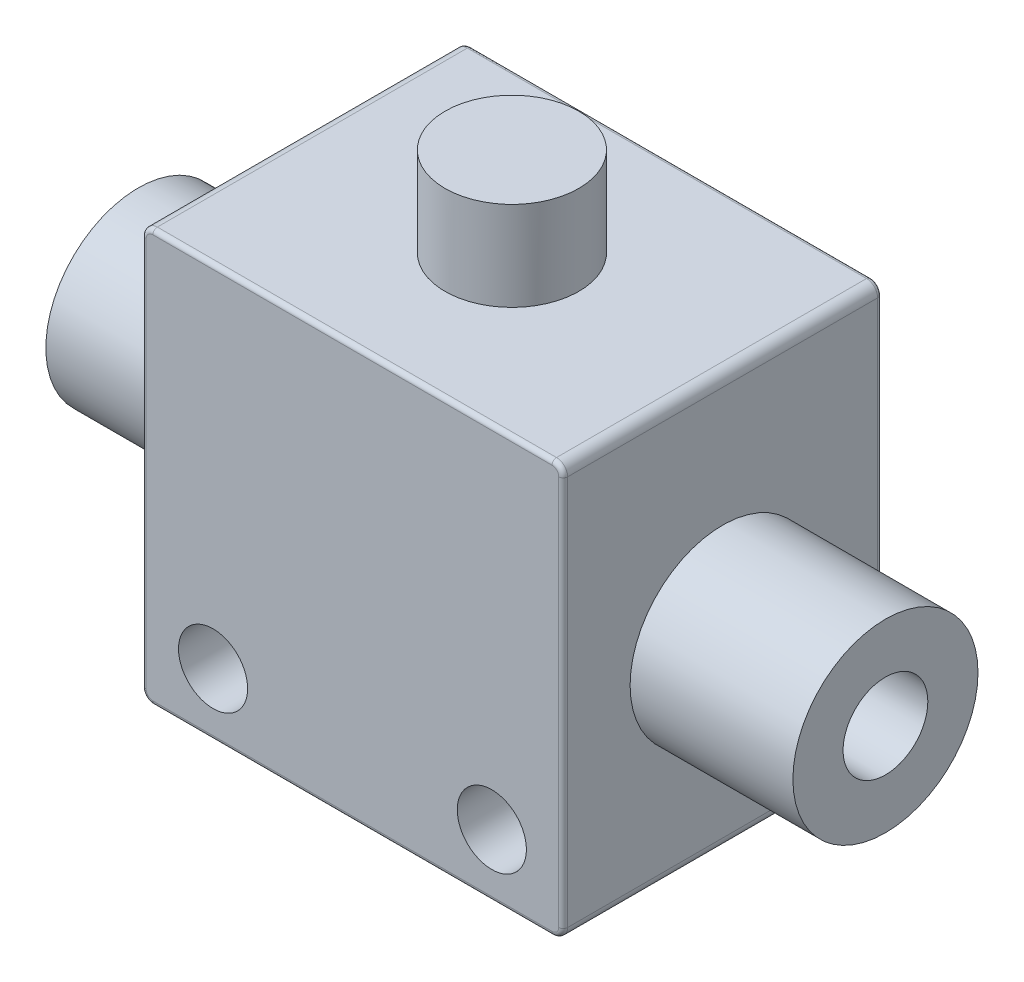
ISO-10303-21;
HEADER;
FILE_DESCRIPTION(('STEP AP214'),'2;1');
FILE_NAME('part.step','',(''),(''),'','','');
FILE_SCHEMA(('AUTOMOTIVE_DESIGN { 1 0 10303 214 1 1 1 1 }'));
ENDSEC;
DATA;
#1=APPLICATION_CONTEXT('core data for automotive mechanical design processes');
#2=APPLICATION_PROTOCOL_DEFINITION('international standard','automotive_design',2000,#1);
#3=PRODUCT_CONTEXT('',#1,'mechanical');
#4=PRODUCT('Part','Part','',(#3));
#5=PRODUCT_RELATED_PRODUCT_CATEGORY('part','',(#4));
#6=PRODUCT_DEFINITION_FORMATION('','',#4);
#7=PRODUCT_DEFINITION_CONTEXT('part definition',#1,'design');
#8=PRODUCT_DEFINITION('design','',#6,#7);
#9=PRODUCT_DEFINITION_SHAPE('','',#8);
#10=(LENGTH_UNIT() NAMED_UNIT(*) SI_UNIT(.MILLI.,.METRE.));
#11=(NAMED_UNIT(*) PLANE_ANGLE_UNIT() SI_UNIT($,.RADIAN.));
#12=(NAMED_UNIT(*) SI_UNIT($,.STERADIAN.) SOLID_ANGLE_UNIT());
#13=UNCERTAINTY_MEASURE_WITH_UNIT(LENGTH_MEASURE(1.E-05),#10,'distance_accuracy_value','');
#14=(GEOMETRIC_REPRESENTATION_CONTEXT(3) GLOBAL_UNCERTAINTY_ASSIGNED_CONTEXT((#13)) GLOBAL_UNIT_ASSIGNED_CONTEXT((#10,
#11,#12)) REPRESENTATION_CONTEXT('',''));
#15=CARTESIAN_POINT('',(0.,0.,0.));
#16=DIRECTION('',(0.,0.,1.));
#17=DIRECTION('',(1.,0.,0.));
#18=AXIS2_PLACEMENT_3D('',#15,#16,#17);
#19=CARTESIAN_POINT('',(0.,23.495,-18.161));
#20=DIRECTION('',(0.,-1.,0.));
#21=DIRECTION('',(0.,0.,-1.));
#22=AXIS2_PLACEMENT_3D('',#19,#20,#21);
#23=PLANE('',#22);
#24=DIRECTION('',(0.,0.,-1.));
#25=VECTOR('',#24,1.);
#26=CARTESIAN_POINT('',(23.368,23.495,-18.161));
#27=LINE('',#26,#25);
#28=CARTESIAN_POINT('',(23.368,23.495,-0.254000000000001));
#29=VERTEX_POINT('',#28);
#30=CARTESIAN_POINT('',(23.368,23.495,-17.907));
#31=VERTEX_POINT('',#30);
#32=EDGE_CURVE('E316',#29,#31,#27,.T.);
#33=ORIENTED_EDGE('',*,*,#32,.T.);
#34=DIRECTION('',(-1.,0.,0.));
#35=VECTOR('',#34,1.);
#36=CARTESIAN_POINT('',(0.,23.495,-17.907));
#37=LINE('',#36,#35);
#38=CARTESIAN_POINT('',(0.635,23.495,-17.907));
#39=VERTEX_POINT('',#38);
#40=EDGE_CURVE('E179',#31,#39,#37,.T.);
#41=ORIENTED_EDGE('',*,*,#40,.T.);
#42=DIRECTION('',(0.,0.,1.));
#43=VECTOR('',#42,1.);
#44=CARTESIAN_POINT('',(0.635,23.495,-18.161));
#45=LINE('',#44,#43);
#46=CARTESIAN_POINT('',(0.635,23.495,-0.254000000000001));
#47=VERTEX_POINT('',#46);
#48=EDGE_CURVE('E313',#39,#47,#45,.T.);
#49=ORIENTED_EDGE('',*,*,#48,.T.);
#50=DIRECTION('',(1.,0.,0.));
#51=VECTOR('',#50,1.);
#52=CARTESIAN_POINT('',(0.,23.495,-0.254000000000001));
#53=LINE('',#52,#51);
#54=EDGE_CURVE('E177',#47,#29,#53,.T.);
#55=ORIENTED_EDGE('',*,*,#54,.T.);
#56=EDGE_LOOP('',(#33,#41,#49,#55));
#57=FACE_BOUND('',#56,.T.);
#58=CARTESIAN_POINT('',(12.0015,23.495,-9.0805));
#59=DIRECTION('',(0.,-1.,0.));
#60=DIRECTION('',(0.,0.,-1.));
#61=AXIS2_PLACEMENT_3D('',#58,#59,#60);
#62=CIRCLE('',#61,3.81);
#63=CARTESIAN_POINT('',(12.0015,23.495,-12.8905));
#64=VERTEX_POINT('',#63);
#65=EDGE_CURVE('E11',#64,#64,#62,.F.);
#66=ORIENTED_EDGE('',*,*,#65,.F.);
#67=EDGE_LOOP('',(#66));
#68=FACE_BOUND('',#67,.T.);
#69=ADVANCED_FACE('F26',(#57,#68),#23,.F.);
#70=CARTESIAN_POINT('',(0.,23.495,0.));
#71=DIRECTION('',(0.,0.,-1.));
#72=DIRECTION('',(-1.,0.,0.));
#73=AXIS2_PLACEMENT_3D('',#70,#71,#72);
#74=PLANE('',#73);
#75=DIRECTION('',(1.,0.,0.));
#76=VECTOR('',#75,1.);
#77=CARTESIAN_POINT('',(0.,23.241,0.));
#78=LINE('',#77,#76);
#79=CARTESIAN_POINT('',(23.368,23.241,0.));
#80=VERTEX_POINT('',#79);
#81=CARTESIAN_POINT('',(0.635,23.241,0.));
#82=VERTEX_POINT('',#81);
#83=EDGE_CURVE('E202',#80,#82,#78,.F.);
#84=ORIENTED_EDGE('',*,*,#83,.T.);
#85=CARTESIAN_POINT('',(0.635,22.86,0.));
#86=DIRECTION('',(0.,0.,-1.));
#87=DIRECTION('',(-1.,0.,0.));
#88=AXIS2_PLACEMENT_3D('',#85,#86,#87);
#89=CIRCLE('',#88,0.381);
#90=CARTESIAN_POINT('',(0.254,22.86,0.));
#91=VERTEX_POINT('',#90);
#92=EDGE_CURVE('E215',#82,#91,#89,.F.);
#93=ORIENTED_EDGE('',*,*,#92,.T.);
#94=DIRECTION('',(0.,-1.,0.));
#95=VECTOR('',#94,1.);
#96=CARTESIAN_POINT('',(0.254,23.495,0.));
#97=LINE('',#96,#95);
#98=CARTESIAN_POINT('',(0.254,0.635,0.));
#99=VERTEX_POINT('',#98);
#100=EDGE_CURVE('E48',#91,#99,#97,.T.);
#101=ORIENTED_EDGE('',*,*,#100,.T.);
#102=CARTESIAN_POINT('',(0.635,0.635,0.));
#103=DIRECTION('',(0.,0.,-1.));
#104=DIRECTION('',(-1.,0.,0.));
#105=AXIS2_PLACEMENT_3D('',#102,#103,#104);
#106=CIRCLE('',#105,0.381);
#107=CARTESIAN_POINT('',(0.635,0.254000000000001,0.));
#108=VERTEX_POINT('',#107);
#109=EDGE_CURVE('E212',#99,#108,#106,.F.);
#110=ORIENTED_EDGE('',*,*,#109,.T.);
#111=DIRECTION('',(1.,0.,0.));
#112=VECTOR('',#111,1.);
#113=CARTESIAN_POINT('',(23.368,0.254000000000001,0.));
#114=LINE('',#113,#112);
#115=CARTESIAN_POINT('',(23.368,0.254,0.));
#116=VERTEX_POINT('',#115);
#117=EDGE_CURVE('E210',#108,#116,#114,.T.);
#118=ORIENTED_EDGE('',*,*,#117,.T.);
#119=CARTESIAN_POINT('',(23.368,0.635,0.));
#120=DIRECTION('',(0.,0.,-1.));
#121=DIRECTION('',(-1.,0.,0.));
#122=AXIS2_PLACEMENT_3D('',#119,#120,#121);
#123=CIRCLE('',#122,0.381);
#124=CARTESIAN_POINT('',(23.749,0.635,0.));
#125=VERTEX_POINT('',#124);
#126=EDGE_CURVE('E208',#116,#125,#123,.F.);
#127=ORIENTED_EDGE('',*,*,#126,.T.);
#128=DIRECTION('',(0.,-1.,0.));
#129=VECTOR('',#128,1.);
#130=CARTESIAN_POINT('',(23.749,23.495,0.));
#131=LINE('',#130,#129);
#132=CARTESIAN_POINT('',(23.749,22.86,0.));
#133=VERTEX_POINT('',#132);
#134=EDGE_CURVE('E206',#125,#133,#131,.F.);
#135=ORIENTED_EDGE('',*,*,#134,.T.);
#136=CARTESIAN_POINT('',(23.368,22.86,0.));
#137=DIRECTION('',(0.,0.,-1.));
#138=DIRECTION('',(-1.,0.,0.));
#139=AXIS2_PLACEMENT_3D('',#136,#137,#138);
#140=CIRCLE('',#139,0.381);
#141=EDGE_CURVE('E204',#133,#80,#140,.F.);
#142=ORIENTED_EDGE('',*,*,#141,.T.);
#143=EDGE_LOOP('',(#84,#93,#101,#110,#118,#127,#135,#142));
#144=FACE_BOUND('',#143,.T.);
#145=CARTESIAN_POINT('',(19.939,3.556,0.));
#146=DIRECTION('',(0.,0.,1.));
#147=DIRECTION('',(1.,0.,0.));
#148=AXIS2_PLACEMENT_3D('',#145,#146,#147);
#149=CIRCLE('',#148,1.9685);
#150=CARTESIAN_POINT('',(21.9075,3.556,0.));
#151=VERTEX_POINT('',#150);
#152=EDGE_CURVE('E290',#151,#151,#149,.T.);
#153=ORIENTED_EDGE('',*,*,#152,.F.);
#154=EDGE_LOOP('',(#153));
#155=FACE_BOUND('',#154,.T.);
#156=CARTESIAN_POINT('',(4.064,3.556,0.));
#157=DIRECTION('',(0.,0.,-1.));
#158=DIRECTION('',(-1.,0.,0.));
#159=AXIS2_PLACEMENT_3D('',#156,#157,#158);
#160=CIRCLE('',#159,1.9685);
#161=CARTESIAN_POINT('',(2.0955,3.556,0.));
#162=VERTEX_POINT('',#161);
#163=EDGE_CURVE('E272',#162,#162,#160,.T.);
#164=ORIENTED_EDGE('',*,*,#163,.T.);
#165=EDGE_LOOP('',(#164));
#166=FACE_BOUND('',#165,.T.);
#167=ADVANCED_FACE('F378',(#144,#155,#166),#74,.F.);
#168=CARTESIAN_POINT('',(0.,23.495,-18.161));
#169=DIRECTION('',(0.,0.,1.));
#170=DIRECTION('',(1.,0.,0.));
#171=AXIS2_PLACEMENT_3D('',#168,#169,#170);
#172=PLANE('',#171);
#173=DIRECTION('',(-1.,0.,0.));
#174=VECTOR('',#173,1.);
#175=CARTESIAN_POINT('',(0.,23.241,-18.161));
#176=LINE('',#175,#174);
#177=CARTESIAN_POINT('',(0.635,23.241,-18.161));
#178=VERTEX_POINT('',#177);
#179=CARTESIAN_POINT('',(23.368,23.241,-18.161));
#180=VERTEX_POINT('',#179);
#181=EDGE_CURVE('E167',#178,#180,#176,.F.);
#182=ORIENTED_EDGE('',*,*,#181,.T.);
#183=CARTESIAN_POINT('',(23.368,22.86,-18.161));
#184=DIRECTION('',(0.,0.,1.));
#185=DIRECTION('',(1.,0.,0.));
#186=AXIS2_PLACEMENT_3D('',#183,#184,#185);
#187=CIRCLE('',#186,0.381);
#188=CARTESIAN_POINT('',(23.749,22.86,-18.161));
#189=VERTEX_POINT('',#188);
#190=EDGE_CURVE('E146',#180,#189,#187,.F.);
#191=ORIENTED_EDGE('',*,*,#190,.T.);
#192=DIRECTION('',(0.,-1.,0.));
#193=VECTOR('',#192,1.);
#194=CARTESIAN_POINT('',(23.749,23.495,-18.161));
#195=LINE('',#194,#193);
#196=CARTESIAN_POINT('',(23.749,0.635,-18.161));
#197=VERTEX_POINT('',#196);
#198=EDGE_CURVE('E155',#189,#197,#195,.T.);
#199=ORIENTED_EDGE('',*,*,#198,.T.);
#200=CARTESIAN_POINT('',(23.368,0.635,-18.161));
#201=DIRECTION('',(0.,0.,1.));
#202=DIRECTION('',(1.,0.,0.));
#203=AXIS2_PLACEMENT_3D('',#200,#201,#202);
#204=CIRCLE('',#203,0.381);
#205=CARTESIAN_POINT('',(23.368,0.254,-18.161));
#206=VERTEX_POINT('',#205);
#207=EDGE_CURVE('E161',#197,#206,#204,.F.);
#208=ORIENTED_EDGE('',*,*,#207,.T.);
#209=DIRECTION('',(-1.,0.,0.));
#210=VECTOR('',#209,1.);
#211=CARTESIAN_POINT('',(0.635,0.254000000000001,-18.161));
#212=LINE('',#211,#210);
#213=CARTESIAN_POINT('',(0.635,0.254000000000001,-18.161));
#214=VERTEX_POINT('',#213);
#215=EDGE_CURVE('E325',#206,#214,#212,.T.);
#216=ORIENTED_EDGE('',*,*,#215,.T.);
#217=CARTESIAN_POINT('',(0.635,0.635,-18.161));
#218=DIRECTION('',(0.,0.,1.));
#219=DIRECTION('',(1.,0.,0.));
#220=AXIS2_PLACEMENT_3D('',#217,#218,#219);
#221=CIRCLE('',#220,0.381);
#222=CARTESIAN_POINT('',(0.254,0.635,-18.161));
#223=VERTEX_POINT('',#222);
#224=EDGE_CURVE('E327',#214,#223,#221,.F.);
#225=ORIENTED_EDGE('',*,*,#224,.T.);
#226=DIRECTION('',(0.,-1.,0.));
#227=VECTOR('',#226,1.);
#228=CARTESIAN_POINT('',(0.254,23.495,-18.161));
#229=LINE('',#228,#227);
#230=CARTESIAN_POINT('',(0.254,22.86,-18.161));
#231=VERTEX_POINT('',#230);
#232=EDGE_CURVE('E329',#223,#231,#229,.F.);
#233=ORIENTED_EDGE('',*,*,#232,.T.);
#234=CARTESIAN_POINT('',(0.635,22.86,-18.161));
#235=DIRECTION('',(0.,0.,1.));
#236=DIRECTION('',(1.,0.,0.));
#237=AXIS2_PLACEMENT_3D('',#234,#235,#236);
#238=CIRCLE('',#237,0.381);
#239=EDGE_CURVE('E172',#231,#178,#238,.F.);
#240=ORIENTED_EDGE('',*,*,#239,.T.);
#241=EDGE_LOOP('',(#182,#191,#199,#208,#216,#225,#233,#240));
#242=FACE_BOUND('',#241,.T.);
#243=CARTESIAN_POINT('',(19.939,3.556,-18.161));
#244=DIRECTION('',(0.,0.,1.));
#245=DIRECTION('',(1.,0.,0.));
#246=AXIS2_PLACEMENT_3D('',#243,#244,#245);
#247=CIRCLE('',#246,1.9685);
#248=CARTESIAN_POINT('',(21.9075,3.556,-18.161));
#249=VERTEX_POINT('',#248);
#250=EDGE_CURVE('E293',#249,#249,#247,.T.);
#251=ORIENTED_EDGE('',*,*,#250,.T.);
#252=EDGE_LOOP('',(#251));
#253=FACE_BOUND('',#252,.T.);
#254=CARTESIAN_POINT('',(4.064,3.556,-18.161));
#255=DIRECTION('',(0.,0.,-1.));
#256=DIRECTION('',(-1.,0.,0.));
#257=AXIS2_PLACEMENT_3D('',#254,#255,#256);
#258=CIRCLE('',#257,1.9685);
#259=CARTESIAN_POINT('',(2.0955,3.556,-18.161));
#260=VERTEX_POINT('',#259);
#261=EDGE_CURVE('E275',#260,#260,#258,.T.);
#262=ORIENTED_EDGE('',*,*,#261,.F.);
#263=EDGE_LOOP('',(#262));
#264=FACE_BOUND('',#263,.T.);
#265=ADVANCED_FACE('F164',(#242,#253,#264),#172,.F.);
#266=CARTESIAN_POINT('',(-9.271,10.795,-9.0805));
#267=DIRECTION('',(-1.,0.,0.));
#268=DIRECTION('',(0.,0.,-1.));
#269=AXIS2_PLACEMENT_3D('',#266,#267,#268);
#270=PLANE('',#269);
#271=CARTESIAN_POINT('',(-9.271,10.795,-9.0805));
#272=DIRECTION('',(1.,0.,0.));
#273=DIRECTION('',(0.,0.,-1.));
#274=AXIS2_PLACEMENT_3D('',#271,#272,#273);
#275=CIRCLE('',#274,5.2705);
#276=CARTESIAN_POINT('',(-9.271,10.795,-14.351));
#277=VERTEX_POINT('',#276);
#278=EDGE_CURVE('E287',#277,#277,#275,.T.);
#279=ORIENTED_EDGE('',*,*,#278,.F.);
#280=EDGE_LOOP('',(#279));
#281=FACE_BOUND('',#280,.T.);
#282=CARTESIAN_POINT('',(-9.271,10.795,-9.0805));
#283=DIRECTION('',(1.,0.,0.));
#284=DIRECTION('',(0.,0.,-1.));
#285=AXIS2_PLACEMENT_3D('',#282,#283,#284);
#286=CIRCLE('',#285,2.413);
#287=CARTESIAN_POINT('',(-9.271,10.795,-6.6675));
#288=VERTEX_POINT('',#287);
#289=EDGE_CURVE('E278',#288,#288,#286,.T.);
#290=ORIENTED_EDGE('',*,*,#289,.T.);
#291=EDGE_LOOP('',(#290));
#292=FACE_BOUND('',#291,.T.);
#293=ADVANCED_FACE('F425',(#281,#292),#270,.T.);
#294=CARTESIAN_POINT('',(24.003,23.495,0.));
#295=DIRECTION('',(-1.,0.,0.));
#296=DIRECTION('',(0.,0.,1.));
#297=AXIS2_PLACEMENT_3D('',#294,#295,#296);
#298=PLANE('',#297);
#299=DIRECTION('',(0.,0.,-1.));
#300=VECTOR('',#299,1.);
#301=CARTESIAN_POINT('',(24.003,22.86,0.));
#302=LINE('',#301,#300);
#303=CARTESIAN_POINT('',(24.003,22.86,-17.907));
#304=VERTEX_POINT('',#303);
#305=CARTESIAN_POINT('',(24.003,22.86,-0.254000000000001));
#306=VERTEX_POINT('',#305);
#307=EDGE_CURVE('E227',#304,#306,#302,.F.);
#308=ORIENTED_EDGE('',*,*,#307,.T.);
#309=DIRECTION('',(0.,-1.,0.));
#310=VECTOR('',#309,1.);
#311=CARTESIAN_POINT('',(24.003,23.495,-0.254));
#312=LINE('',#311,#310);
#313=CARTESIAN_POINT('',(24.003,0.635,-0.254000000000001));
#314=VERTEX_POINT('',#313);
#315=EDGE_CURVE('E34',#306,#314,#312,.T.);
#316=ORIENTED_EDGE('',*,*,#315,.T.);
#317=DIRECTION('',(0.,0.,-1.));
#318=VECTOR('',#317,1.);
#319=CARTESIAN_POINT('',(24.003,0.635,-18.161));
#320=LINE('',#319,#318);
#321=CARTESIAN_POINT('',(24.003,0.635,-17.907));
#322=VERTEX_POINT('',#321);
#323=EDGE_CURVE('E225',#314,#322,#320,.T.);
#324=ORIENTED_EDGE('',*,*,#323,.T.);
#325=DIRECTION('',(0.,-1.,0.));
#326=VECTOR('',#325,1.);
#327=CARTESIAN_POINT('',(24.003,23.495,-17.907));
#328=LINE('',#327,#326);
#329=EDGE_CURVE('E217',#322,#304,#328,.F.);
#330=ORIENTED_EDGE('',*,*,#329,.T.);
#331=EDGE_LOOP('',(#308,#316,#324,#330));
#332=FACE_BOUND('',#331,.T.);
#333=CARTESIAN_POINT('',(24.003,10.795,-9.0805));
#334=DIRECTION('',(-1.,0.,0.));
#335=DIRECTION('',(0.,0.,1.));
#336=AXIS2_PLACEMENT_3D('',#333,#334,#335);
#337=CIRCLE('',#336,5.2705);
#338=CARTESIAN_POINT('',(24.003,10.795,-3.81));
#339=VERTEX_POINT('',#338);
#340=EDGE_CURVE('E305',#339,#339,#337,.F.);
#341=ORIENTED_EDGE('',*,*,#340,.F.);
#342=EDGE_LOOP('',(#341));
#343=FACE_BOUND('',#342,.T.);
#344=ADVANCED_FACE('F223',(#332,#343),#298,.F.);
#345=CARTESIAN_POINT('',(0.,23.495,0.));
#346=DIRECTION('',(1.,0.,0.));
#347=DIRECTION('',(0.,0.,-1.));
#348=AXIS2_PLACEMENT_3D('',#345,#346,#347);
#349=PLANE('',#348);
#350=CARTESIAN_POINT('',(0.,10.795,-9.0805));
#351=DIRECTION('',(1.,0.,0.));
#352=DIRECTION('',(0.,0.,-1.));
#353=AXIS2_PLACEMENT_3D('',#350,#351,#352);
#354=CIRCLE('',#353,5.2705);
#355=CARTESIAN_POINT('',(0.,10.795,-14.351));
#356=VERTEX_POINT('',#355);
#357=EDGE_CURVE('E284',#356,#356,#354,.T.);
#358=ORIENTED_EDGE('',*,*,#357,.T.);
#359=EDGE_LOOP('',(#358));
#360=FACE_BOUND('',#359,.T.);
#361=DIRECTION('',(0.,0.,1.));
#362=VECTOR('',#361,1.);
#363=CARTESIAN_POINT('',(0.,22.86,0.));
#364=LINE('',#363,#362);
#365=CARTESIAN_POINT('',(0.,22.86,-0.254));
#366=VERTEX_POINT('',#365);
#367=CARTESIAN_POINT('',(0.,22.86,-17.907));
#368=VERTEX_POINT('',#367);
#369=EDGE_CURVE('E319',#366,#368,#364,.F.);
#370=ORIENTED_EDGE('',*,*,#369,.T.);
#371=DIRECTION('',(0.,-1.,0.));
#372=VECTOR('',#371,1.);
#373=CARTESIAN_POINT('',(0.,23.495,-17.907));
#374=LINE('',#373,#372);
#375=CARTESIAN_POINT('',(0.,0.635,-17.907));
#376=VERTEX_POINT('',#375);
#377=EDGE_CURVE('E188',#368,#376,#374,.T.);
#378=ORIENTED_EDGE('',*,*,#377,.T.);
#379=DIRECTION('',(0.,0.,1.));
#380=VECTOR('',#379,1.);
#381=CARTESIAN_POINT('',(0.,0.635,0.));
#382=LINE('',#381,#380);
#383=CARTESIAN_POINT('',(0.,0.635,-0.254));
#384=VERTEX_POINT('',#383);
#385=EDGE_CURVE('E162',#376,#384,#382,.T.);
#386=ORIENTED_EDGE('',*,*,#385,.T.);
#387=DIRECTION('',(0.,-1.,0.));
#388=VECTOR('',#387,1.);
#389=CARTESIAN_POINT('',(0.,23.495,-0.254));
#390=LINE('',#389,#388);
#391=EDGE_CURVE('E186',#384,#366,#390,.F.);
#392=ORIENTED_EDGE('',*,*,#391,.T.);
#393=EDGE_LOOP('',(#370,#378,#386,#392));
#394=FACE_BOUND('',#393,.T.);
#395=ADVANCED_FACE('F28',(#360,#394),#349,.F.);
#396=CARTESIAN_POINT('',(0.,0.,-18.161));
#397=DIRECTION('',(0.,-1.,0.));
#398=DIRECTION('',(0.,0.,-1.));
#399=AXIS2_PLACEMENT_3D('',#396,#397,#398);
#400=PLANE('',#399);
#401=DIRECTION('',(0.,0.,1.));
#402=VECTOR('',#401,1.);
#403=CARTESIAN_POINT('',(0.635,0.,-18.161));
#404=LINE('',#403,#402);
#405=CARTESIAN_POINT('',(0.635,0.,-0.254000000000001));
#406=VERTEX_POINT('',#405);
#407=CARTESIAN_POINT('',(0.635,0.,-17.907));
#408=VERTEX_POINT('',#407);
#409=EDGE_CURVE('E238',#406,#408,#404,.F.);
#410=ORIENTED_EDGE('',*,*,#409,.T.);
#411=DIRECTION('',(-1.,0.,0.));
#412=VECTOR('',#411,1.);
#413=CARTESIAN_POINT('',(23.368,0.,-17.907));
#414=LINE('',#413,#412);
#415=CARTESIAN_POINT('',(23.368,0.,-17.907));
#416=VERTEX_POINT('',#415);
#417=EDGE_CURVE('E196',#408,#416,#414,.F.);
#418=ORIENTED_EDGE('',*,*,#417,.T.);
#419=DIRECTION('',(0.,0.,-1.));
#420=VECTOR('',#419,1.);
#421=CARTESIAN_POINT('',(23.368,0.,0.));
#422=LINE('',#421,#420);
#423=CARTESIAN_POINT('',(23.368,0.,-0.254));
#424=VERTEX_POINT('',#423);
#425=EDGE_CURVE('E311',#416,#424,#422,.F.);
#426=ORIENTED_EDGE('',*,*,#425,.T.);
#427=DIRECTION('',(1.,0.,0.));
#428=VECTOR('',#427,1.);
#429=CARTESIAN_POINT('',(0.635,0.,-0.254));
#430=LINE('',#429,#428);
#431=EDGE_CURVE('E194',#424,#406,#430,.F.);
#432=ORIENTED_EDGE('',*,*,#431,.T.);
#433=EDGE_LOOP('',(#410,#418,#426,#432));
#434=FACE_BOUND('',#433,.T.);
#435=ADVANCED_FACE('F387',(#434),#400,.T.);
#436=CARTESIAN_POINT('',(33.274,10.795,-9.0805));
#437=DIRECTION('',(-1.,0.,0.));
#438=DIRECTION('',(0.,0.,1.));
#439=AXIS2_PLACEMENT_3D('',#436,#437,#438);
#440=CYLINDRICAL_SURFACE('',#439,5.2705);
#441=CARTESIAN_POINT('',(33.274,10.795,-9.0805));
#442=DIRECTION('',(1.,0.,0.));
#443=DIRECTION('',(0.,0.,-1.));
#444=AXIS2_PLACEMENT_3D('',#441,#442,#443);
#445=CIRCLE('',#444,5.2705);
#446=CARTESIAN_POINT('',(33.274,10.795,-14.351));
#447=VERTEX_POINT('',#446);
#448=EDGE_CURVE('E302',#447,#447,#445,.T.);
#449=ORIENTED_EDGE('',*,*,#448,.F.);
#450=EDGE_LOOP('',(#449));
#451=FACE_BOUND('',#450,.T.);
#452=ORIENTED_EDGE('',*,*,#340,.T.);
#453=EDGE_LOOP('',(#452));
#454=FACE_BOUND('',#453,.T.);
#455=ADVANCED_FACE('F460',(#451,#454),#440,.T.);
#456=CARTESIAN_POINT('',(33.274,10.795,-9.0805));
#457=DIRECTION('',(1.,0.,0.));
#458=DIRECTION('',(0.,0.,-1.));
#459=AXIS2_PLACEMENT_3D('',#456,#457,#458);
#460=PLANE('',#459);
#461=CARTESIAN_POINT('',(33.274,10.795,-9.0805));
#462=DIRECTION('',(1.,0.,0.));
#463=DIRECTION('',(0.,0.,-1.));
#464=AXIS2_PLACEMENT_3D('',#461,#462,#463);
#465=CIRCLE('',#464,2.413);
#466=CARTESIAN_POINT('',(33.274,10.795,-11.4935));
#467=VERTEX_POINT('',#466);
#468=EDGE_CURVE('E296',#467,#467,#465,.T.);
#469=ORIENTED_EDGE('',*,*,#468,.F.);
#470=EDGE_LOOP('',(#469));
#471=FACE_BOUND('',#470,.T.);
#472=ORIENTED_EDGE('',*,*,#448,.T.);
#473=EDGE_LOOP('',(#472));
#474=FACE_BOUND('',#473,.T.);
#475=ADVANCED_FACE('F457',(#471,#474),#460,.T.);
#476=CARTESIAN_POINT('',(14.224,10.795,-9.0805));
#477=DIRECTION('',(1.,0.,0.));
#478=DIRECTION('',(0.,0.,-1.));
#479=AXIS2_PLACEMENT_3D('',#476,#477,#478);
#480=CYLINDRICAL_SURFACE('',#479,2.413);
#481=CARTESIAN_POINT('',(14.224,10.795,-9.0805));
#482=DIRECTION('',(1.,0.,0.));
#483=DIRECTION('',(0.,0.,-1.));
#484=AXIS2_PLACEMENT_3D('',#481,#482,#483);
#485=CIRCLE('',#484,2.413);
#486=CARTESIAN_POINT('',(14.224,10.795,-11.4935));
#487=VERTEX_POINT('',#486);
#488=EDGE_CURVE('E299',#487,#487,#485,.T.);
#489=CARTESIAN_POINT('',(14.224,10.795,-11.4935));
#490=CARTESIAN_POINT('',(14.4224375,10.795,-11.4935));
#491=CARTESIAN_POINT('',(14.620875,10.795,-11.4935));
#492=CARTESIAN_POINT('',(15.01775,10.795,-11.4935));
#493=CARTESIAN_POINT('',(15.2161875,10.795,-11.4935));
#494=CARTESIAN_POINT('',(15.6130625,10.795,-11.4935));
#495=CARTESIAN_POINT('',(15.8115,10.795,-11.4935));
#496=CARTESIAN_POINT('',(16.208375,10.795,-11.4935));
#497=CARTESIAN_POINT('',(16.4068125,10.795,-11.4935));
#498=CARTESIAN_POINT('',(16.8036875,10.795,-11.4935));
#499=CARTESIAN_POINT('',(17.002125,10.795,-11.4935));
#500=CARTESIAN_POINT('',(17.399,10.795,-11.4935));
#501=CARTESIAN_POINT('',(17.5974375,10.795,-11.4935));
#502=CARTESIAN_POINT('',(17.9943125,10.795,-11.4935));
#503=CARTESIAN_POINT('',(18.19275,10.795,-11.4935));
#504=CARTESIAN_POINT('',(18.589625,10.795,-11.4935));
#505=CARTESIAN_POINT('',(18.7880625,10.795,-11.4935));
#506=CARTESIAN_POINT('',(19.1849375,10.795,-11.4935));
#507=CARTESIAN_POINT('',(19.383375,10.795,-11.4935));
#508=CARTESIAN_POINT('',(19.78025,10.795,-11.4935));
#509=CARTESIAN_POINT('',(19.9786875,10.795,-11.4935));
#510=CARTESIAN_POINT('',(20.3755625,10.795,-11.4935));
#511=CARTESIAN_POINT('',(20.574,10.795,-11.4935));
#512=CARTESIAN_POINT('',(20.970875,10.795,-11.4935));
#513=CARTESIAN_POINT('',(21.1693125,10.795,-11.4935));
#514=CARTESIAN_POINT('',(21.5661875,10.795,-11.4935));
#515=CARTESIAN_POINT('',(21.764625,10.795,-11.4935));
#516=CARTESIAN_POINT('',(22.1615,10.795,-11.4935));
#517=CARTESIAN_POINT('',(22.3599375,10.795,-11.4935));
#518=CARTESIAN_POINT('',(22.7568125,10.795,-11.4935));
#519=CARTESIAN_POINT('',(22.95525,10.795,-11.4935));
#520=CARTESIAN_POINT('',(23.352125,10.795,-11.4935));
#521=CARTESIAN_POINT('',(23.5505625,10.795,-11.4935));
#522=CARTESIAN_POINT('',(23.9474375,10.795,-11.4935));
#523=CARTESIAN_POINT('',(24.145875,10.795,-11.4935));
#524=CARTESIAN_POINT('',(24.54275,10.795,-11.4935));
#525=CARTESIAN_POINT('',(24.7411875,10.795,-11.4935));
#526=CARTESIAN_POINT('',(25.1380625,10.795,-11.4935));
#527=CARTESIAN_POINT('',(25.3365,10.795,-11.4935));
#528=CARTESIAN_POINT('',(25.733375,10.795,-11.4935));
#529=CARTESIAN_POINT('',(25.9318125,10.795,-11.4935));
#530=CARTESIAN_POINT('',(26.3286875,10.795,-11.4935));
#531=CARTESIAN_POINT('',(26.527125,10.795,-11.4935));
#532=CARTESIAN_POINT('',(26.924,10.795,-11.4935));
#533=CARTESIAN_POINT('',(27.1224375,10.795,-11.4935));
#534=CARTESIAN_POINT('',(27.5193125,10.795,-11.4935));
#535=CARTESIAN_POINT('',(27.71775,10.795,-11.4935));
#536=CARTESIAN_POINT('',(28.114625,10.795,-11.4935));
#537=CARTESIAN_POINT('',(28.3130625,10.795,-11.4935));
#538=CARTESIAN_POINT('',(28.7099375,10.795,-11.4935));
#539=CARTESIAN_POINT('',(28.908375,10.795,-11.4935));
#540=CARTESIAN_POINT('',(29.30525,10.795,-11.4935));
#541=CARTESIAN_POINT('',(29.5036875,10.795,-11.4935));
#542=CARTESIAN_POINT('',(29.9005625,10.795,-11.4935));
#543=CARTESIAN_POINT('',(30.099,10.795,-11.4935));
#544=CARTESIAN_POINT('',(30.495875,10.795,-11.4935));
#545=CARTESIAN_POINT('',(30.6943125,10.795,-11.4935));
#546=CARTESIAN_POINT('',(31.0911875,10.795,-11.4935));
#547=CARTESIAN_POINT('',(31.289625,10.795,-11.4935));
#548=CARTESIAN_POINT('',(31.6865,10.795,-11.4935));
#549=CARTESIAN_POINT('',(31.8849375,10.795,-11.4935));
#550=CARTESIAN_POINT('',(32.2818125,10.795,-11.4935));
#551=CARTESIAN_POINT('',(32.48025,10.795,-11.4935));
#552=CARTESIAN_POINT('',(32.877125,10.795,-11.4935));
#553=CARTESIAN_POINT('',(33.0755625,10.795,-11.4935));
#554=CARTESIAN_POINT('',(33.274,10.795,-11.4935));
#555=B_SPLINE_CURVE_WITH_KNOTS('',3,(#489,#490,#491,#492,#493,#494,#495,#496,#497,#498,#499,
#500,#501,#502,#503,#504,#505,#506,#507,#508,#509,#510,#511,#512,#513,#514,#515,#516,#517,#518,
#519,#520,#521,#522,#523,#524,#525,#526,#527,#528,#529,#530,#531,#532,#533,#534,#535,#536,#537,
#538,#539,#540,#541,#542,#543,#544,#545,#546,#547,#548,#549,#550,#551,#552,#553,#554),
.UNSPECIFIED.,.F.,.F.,(4,2,2,2,2,2,2,2,2,2,2,2,2,2,2,2,2,2,2,2,2,2,2,2,2,2,2,2,2,2,2,2,4),(0.,
0.5953125,1.190625,1.7859375,2.38125,2.9765625,3.571875,4.1671875,4.7625,5.3578125,5.953125,
6.5484375,7.14375,7.7390625,8.334375,8.9296875,9.525,10.1203125,10.715625,11.3109375,11.90625,
12.5015625,13.096875,13.6921875,14.2875,14.8828125,15.478125,16.0734375,16.66875,17.2640625,
17.859375,18.4546875,19.05),.UNSPECIFIED.);
#556=EDGE_CURVE('BSEAM453',#487,#467,#555,.T.);
#557=ORIENTED_EDGE('',*,*,#488,.F.);
#558=ORIENTED_EDGE('',*,*,#468,.T.);
#559=ORIENTED_EDGE('',*,*,#556,.T.);
#560=ORIENTED_EDGE('',*,*,#556,.F.);
#561=EDGE_LOOP('',(#557,#559,#558,#560));
#562=FACE_BOUND('',#561,.T.);
#563=ADVANCED_FACE('F453',(#562),#480,.F.);
#564=CARTESIAN_POINT('',(14.224,10.795,-9.0805));
#565=DIRECTION('',(1.,0.,0.));
#566=DIRECTION('',(0.,0.,-1.));
#567=AXIS2_PLACEMENT_3D('',#564,#565,#566);
#568=PLANE('',#567);
#569=ORIENTED_EDGE('',*,*,#488,.T.);
#570=EDGE_LOOP('',(#569));
#571=FACE_BOUND('',#570,.T.);
#572=ADVANCED_FACE('F449',(#571),#568,.T.);
#573=CARTESIAN_POINT('',(19.939,3.556,-18.161));
#574=DIRECTION('',(0.,0.,1.));
#575=DIRECTION('',(1.,0.,0.));
#576=AXIS2_PLACEMENT_3D('',#573,#574,#575);
#577=CYLINDRICAL_SURFACE('',#576,1.9685);
#578=ORIENTED_EDGE('',*,*,#250,.F.);
#579=EDGE_LOOP('',(#578));
#580=FACE_BOUND('',#579,.T.);
#581=ORIENTED_EDGE('',*,*,#152,.T.);
#582=EDGE_LOOP('',(#581));
#583=FACE_BOUND('',#582,.T.);
#584=ADVANCED_FACE('F446',(#580,#583),#577,.F.);
#585=CARTESIAN_POINT('',(-9.271,10.795,-9.0805));
#586=DIRECTION('',(1.,0.,0.));
#587=DIRECTION('',(0.,0.,-1.));
#588=AXIS2_PLACEMENT_3D('',#585,#586,#587);
#589=CYLINDRICAL_SURFACE('',#588,5.2705);
#590=ORIENTED_EDGE('',*,*,#278,.T.);
#591=EDGE_LOOP('',(#590));
#592=FACE_BOUND('',#591,.T.);
#593=ORIENTED_EDGE('',*,*,#357,.F.);
#594=EDGE_LOOP('',(#593));
#595=FACE_BOUND('',#594,.T.);
#596=ADVANCED_FACE('F444',(#592,#595),#589,.T.);
#597=CARTESIAN_POINT('',(9.779,10.795,-9.0805));
#598=DIRECTION('',(-1.,0.,0.));
#599=DIRECTION('',(0.,0.,1.));
#600=AXIS2_PLACEMENT_3D('',#597,#598,#599);
#601=CYLINDRICAL_SURFACE('',#600,2.413);
#602=CARTESIAN_POINT('',(9.779,10.795,-9.0805));
#603=DIRECTION('',(1.,0.,0.));
#604=DIRECTION('',(0.,0.,-1.));
#605=AXIS2_PLACEMENT_3D('',#602,#603,#604);
#606=CIRCLE('',#605,2.413);
#607=CARTESIAN_POINT('',(9.779,10.795,-6.6675));
#608=VERTEX_POINT('',#607);
#609=EDGE_CURVE('E281',#608,#608,#606,.T.);
#610=CARTESIAN_POINT('',(9.779,10.795,-6.6675));
#611=CARTESIAN_POINT('',(9.5805625,10.795,-6.6675));
#612=CARTESIAN_POINT('',(9.382125,10.795,-6.6675));
#613=CARTESIAN_POINT('',(8.98525,10.795,-6.6675));
#614=CARTESIAN_POINT('',(8.7868125,10.795,-6.6675));
#615=CARTESIAN_POINT('',(8.3899375,10.795,-6.6675));
#616=CARTESIAN_POINT('',(8.1915,10.795,-6.6675));
#617=CARTESIAN_POINT('',(7.794625,10.795,-6.6675));
#618=CARTESIAN_POINT('',(7.5961875,10.795,-6.6675));
#619=CARTESIAN_POINT('',(7.1993125,10.795,-6.6675));
#620=CARTESIAN_POINT('',(7.000875,10.795,-6.6675));
#621=CARTESIAN_POINT('',(6.604,10.795,-6.6675));
#622=CARTESIAN_POINT('',(6.4055625,10.795,-6.6675));
#623=CARTESIAN_POINT('',(6.0086875,10.795,-6.6675));
#624=CARTESIAN_POINT('',(5.81025,10.795,-6.6675));
#625=CARTESIAN_POINT('',(5.413375,10.795,-6.6675));
#626=CARTESIAN_POINT('',(5.2149375,10.795,-6.6675));
#627=CARTESIAN_POINT('',(4.8180625,10.795,-6.6675));
#628=CARTESIAN_POINT('',(4.619625,10.795,-6.6675));
#629=CARTESIAN_POINT('',(4.22275,10.795,-6.6675));
#630=CARTESIAN_POINT('',(4.0243125,10.795,-6.6675));
#631=CARTESIAN_POINT('',(3.6274375,10.795,-6.6675));
#632=CARTESIAN_POINT('',(3.429,10.795,-6.6675));
#633=CARTESIAN_POINT('',(3.032125,10.795,-6.6675));
#634=CARTESIAN_POINT('',(2.8336875,10.795,-6.6675));
#635=CARTESIAN_POINT('',(2.4368125,10.795,-6.6675));
#636=CARTESIAN_POINT('',(2.238375,10.795,-6.6675));
#637=CARTESIAN_POINT('',(1.8415,10.795,-6.6675));
#638=CARTESIAN_POINT('',(1.6430625,10.795,-6.6675));
#639=CARTESIAN_POINT('',(1.2461875,10.795,-6.6675));
#640=CARTESIAN_POINT('',(1.04775,10.795,-6.6675));
#641=CARTESIAN_POINT('',(0.650874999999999,10.795,-6.6675));
#642=CARTESIAN_POINT('',(0.452437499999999,10.795,-6.6675));
#643=CARTESIAN_POINT('',(0.0555624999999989,10.795,-6.6675));
#644=CARTESIAN_POINT('',(-0.142875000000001,10.795,-6.6675));
#645=CARTESIAN_POINT('',(-0.539750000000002,10.795,-6.6675));
#646=CARTESIAN_POINT('',(-0.738187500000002,10.795,-6.6675));
#647=CARTESIAN_POINT('',(-1.1350625,10.795,-6.6675));
#648=CARTESIAN_POINT('',(-1.3335,10.795,-6.6675));
#649=CARTESIAN_POINT('',(-1.730375,10.795,-6.6675));
#650=CARTESIAN_POINT('',(-1.9288125,10.795,-6.6675));
#651=CARTESIAN_POINT('',(-2.3256875,10.795,-6.6675));
#652=CARTESIAN_POINT('',(-2.524125,10.795,-6.6675));
#653=CARTESIAN_POINT('',(-2.921,10.795,-6.6675));
#654=CARTESIAN_POINT('',(-3.1194375,10.795,-6.6675));
#655=CARTESIAN_POINT('',(-3.5163125,10.795,-6.6675));
#656=CARTESIAN_POINT('',(-3.71475,10.795,-6.6675));
#657=CARTESIAN_POINT('',(-4.111625,10.795,-6.6675));
#658=CARTESIAN_POINT('',(-4.3100625,10.795,-6.6675));
#659=CARTESIAN_POINT('',(-4.7069375,10.795,-6.6675));
#660=CARTESIAN_POINT('',(-4.905375,10.795,-6.6675));
#661=CARTESIAN_POINT('',(-5.30225,10.795,-6.6675));
#662=CARTESIAN_POINT('',(-5.5006875,10.795,-6.6675));
#663=CARTESIAN_POINT('',(-5.8975625,10.795,-6.6675));
#664=CARTESIAN_POINT('',(-6.096,10.795,-6.6675));
#665=CARTESIAN_POINT('',(-6.492875,10.795,-6.6675));
#666=CARTESIAN_POINT('',(-6.6913125,10.795,-6.6675));
#667=CARTESIAN_POINT('',(-7.0881875,10.795,-6.6675));
#668=CARTESIAN_POINT('',(-7.286625,10.795,-6.6675));
#669=CARTESIAN_POINT('',(-7.6835,10.795,-6.6675));
#670=CARTESIAN_POINT('',(-7.8819375,10.795,-6.6675));
#671=CARTESIAN_POINT('',(-8.2788125,10.795,-6.6675));
#672=CARTESIAN_POINT('',(-8.47725,10.795,-6.6675));
#673=CARTESIAN_POINT('',(-8.874125,10.795,-6.6675));
#674=CARTESIAN_POINT('',(-9.0725625,10.795,-6.6675));
#675=CARTESIAN_POINT('',(-9.271,10.795,-6.6675));
#676=B_SPLINE_CURVE_WITH_KNOTS('',3,(#610,#611,#612,#613,#614,#615,#616,#617,#618,#619,#620,
#621,#622,#623,#624,#625,#626,#627,#628,#629,#630,#631,#632,#633,#634,#635,#636,#637,#638,#639,
#640,#641,#642,#643,#644,#645,#646,#647,#648,#649,#650,#651,#652,#653,#654,#655,#656,#657,#658,
#659,#660,#661,#662,#663,#664,#665,#666,#667,#668,#669,#670,#671,#672,#673,#674,#675),
.UNSPECIFIED.,.F.,.F.,(4,2,2,2,2,2,2,2,2,2,2,2,2,2,2,2,2,2,2,2,2,2,2,2,2,2,2,2,2,2,2,2,4),(0.,
0.5953125,1.190625,1.7859375,2.38125,2.9765625,3.571875,4.1671875,4.7625,5.3578125,5.953125,
6.5484375,7.14375,7.7390625,8.334375,8.9296875,9.525,10.1203125,10.715625,11.3109375,11.90625,
12.5015625,13.096875,13.6921875,14.2875,14.8828125,15.478125,16.0734375,16.66875,17.2640625,
17.859375,18.4546875,19.05),.UNSPECIFIED.);
#677=EDGE_CURVE('BSEAM442',#608,#288,#676,.T.);
#678=ORIENTED_EDGE('',*,*,#609,.T.);
#679=ORIENTED_EDGE('',*,*,#289,.F.);
#680=ORIENTED_EDGE('',*,*,#677,.T.);
#681=ORIENTED_EDGE('',*,*,#677,.F.);
#682=EDGE_LOOP('',(#678,#680,#679,#681));
#683=FACE_BOUND('',#682,.T.);
#684=ADVANCED_FACE('F442',(#683),#601,.F.);
#685=CARTESIAN_POINT('',(9.779,10.795,-9.0805));
#686=DIRECTION('',(-1.,0.,0.));
#687=DIRECTION('',(0.,0.,-1.));
#688=AXIS2_PLACEMENT_3D('',#685,#686,#687);
#689=PLANE('',#688);
#690=ORIENTED_EDGE('',*,*,#609,.F.);
#691=EDGE_LOOP('',(#690));
#692=FACE_BOUND('',#691,.T.);
#693=ADVANCED_FACE('F616',(#692),#689,.T.);
#694=CARTESIAN_POINT('',(4.064,3.556,-18.161));
#695=DIRECTION('',(0.,0.,1.));
#696=DIRECTION('',(1.,0.,0.));
#697=AXIS2_PLACEMENT_3D('',#694,#695,#696);
#698=CYLINDRICAL_SURFACE('',#697,1.9685);
#699=ORIENTED_EDGE('',*,*,#261,.T.);
#700=EDGE_LOOP('',(#699));
#701=FACE_BOUND('',#700,.T.);
#702=ORIENTED_EDGE('',*,*,#163,.F.);
#703=EDGE_LOOP('',(#702));
#704=FACE_BOUND('',#703,.T.);
#705=ADVANCED_FACE('F481',(#701,#704),#698,.F.);
#706=CARTESIAN_POINT('',(23.368,0.635,0.));
#707=DIRECTION('',(0.,0.,1.));
#708=DIRECTION('',(1.,0.,0.));
#709=AXIS2_PLACEMENT_3D('',#706,#707,#708);
#710=CYLINDRICAL_SURFACE('',#709,0.635);
#711=ORIENTED_EDGE('',*,*,#425,.F.);
#712=CARTESIAN_POINT('',(23.368,0.635,-17.907));
#713=DIRECTION('',(0.,0.,1.));
#714=DIRECTION('',(1.,0.,0.));
#715=AXIS2_PLACEMENT_3D('',#712,#713,#714);
#716=CIRCLE('',#715,0.635);
#717=EDGE_CURVE('E200',#416,#322,#716,.T.);
#718=ORIENTED_EDGE('',*,*,#717,.T.);
#719=ORIENTED_EDGE('',*,*,#323,.F.);
#720=CARTESIAN_POINT('',(23.368,0.635,-0.254));
#721=DIRECTION('',(0.,0.,-1.));
#722=DIRECTION('',(-1.,0.,0.));
#723=AXIS2_PLACEMENT_3D('',#720,#721,#722);
#724=CIRCLE('',#723,0.635);
#725=EDGE_CURVE('E198',#314,#424,#724,.T.);
#726=ORIENTED_EDGE('',*,*,#725,.T.);
#727=EDGE_LOOP('',(#711,#718,#719,#726));
#728=FACE_BOUND('',#727,.T.);
#729=ADVANCED_FACE('F235',(#728),#710,.T.);
#730=CARTESIAN_POINT('',(23.368,22.86,-18.161));
#731=DIRECTION('',(0.,0.,-1.));
#732=DIRECTION('',(-1.,0.,0.));
#733=AXIS2_PLACEMENT_3D('',#730,#731,#732);
#734=CYLINDRICAL_SURFACE('',#733,0.635);
#735=ORIENTED_EDGE('',*,*,#307,.F.);
#736=CARTESIAN_POINT('',(23.368,22.86,-17.907));
#737=DIRECTION('',(0.,0.,1.));
#738=DIRECTION('',(1.,0.,0.));
#739=AXIS2_PLACEMENT_3D('',#736,#737,#738);
#740=CIRCLE('',#739,0.635);
#741=EDGE_CURVE('E148',#304,#31,#740,.T.);
#742=ORIENTED_EDGE('',*,*,#741,.T.);
#743=ORIENTED_EDGE('',*,*,#32,.F.);
#744=CARTESIAN_POINT('',(23.368,22.86,-0.254000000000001));
#745=DIRECTION('',(0.,0.,-1.));
#746=DIRECTION('',(-1.,0.,0.));
#747=AXIS2_PLACEMENT_3D('',#744,#745,#746);
#748=CIRCLE('',#747,0.635);
#749=EDGE_CURVE('E169',#29,#306,#748,.T.);
#750=ORIENTED_EDGE('',*,*,#749,.T.);
#751=EDGE_LOOP('',(#735,#742,#743,#750));
#752=FACE_BOUND('',#751,.T.);
#753=ADVANCED_FACE('F344',(#752),#734,.T.);
#754=CARTESIAN_POINT('',(0.635,0.635,0.));
#755=DIRECTION('',(0.,0.,-1.));
#756=DIRECTION('',(-1.,0.,0.));
#757=AXIS2_PLACEMENT_3D('',#754,#755,#756);
#758=CYLINDRICAL_SURFACE('',#757,0.635);
#759=ORIENTED_EDGE('',*,*,#385,.F.);
#760=CARTESIAN_POINT('',(0.635,0.635,-17.907));
#761=DIRECTION('',(0.,0.,1.));
#762=DIRECTION('',(1.,0.,0.));
#763=AXIS2_PLACEMENT_3D('',#760,#761,#762);
#764=CIRCLE('',#763,0.635);
#765=EDGE_CURVE('E192',#376,#408,#764,.T.);
#766=ORIENTED_EDGE('',*,*,#765,.T.);
#767=ORIENTED_EDGE('',*,*,#409,.F.);
#768=CARTESIAN_POINT('',(0.635,0.635,-0.254));
#769=DIRECTION('',(0.,0.,-1.));
#770=DIRECTION('',(-1.,0.,0.));
#771=AXIS2_PLACEMENT_3D('',#768,#769,#770);
#772=CIRCLE('',#771,0.635);
#773=EDGE_CURVE('E190',#406,#384,#772,.T.);
#774=ORIENTED_EDGE('',*,*,#773,.T.);
#775=EDGE_LOOP('',(#759,#766,#767,#774));
#776=FACE_BOUND('',#775,.T.);
#777=ADVANCED_FACE('F391',(#776),#758,.T.);
#778=CARTESIAN_POINT('',(0.635,22.86,-18.161));
#779=DIRECTION('',(0.,0.,1.));
#780=DIRECTION('',(1.,0.,0.));
#781=AXIS2_PLACEMENT_3D('',#778,#779,#780);
#782=CYLINDRICAL_SURFACE('',#781,0.635);
#783=ORIENTED_EDGE('',*,*,#48,.F.);
#784=CARTESIAN_POINT('',(0.635,22.86,-17.907));
#785=DIRECTION('',(0.,0.,1.));
#786=DIRECTION('',(1.,0.,0.));
#787=AXIS2_PLACEMENT_3D('',#784,#785,#786);
#788=CIRCLE('',#787,0.635);
#789=EDGE_CURVE('E184',#39,#368,#788,.T.);
#790=ORIENTED_EDGE('',*,*,#789,.T.);
#791=ORIENTED_EDGE('',*,*,#369,.F.);
#792=CARTESIAN_POINT('',(0.635,22.86,-0.254000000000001));
#793=DIRECTION('',(0.,0.,-1.));
#794=DIRECTION('',(-1.,0.,0.));
#795=AXIS2_PLACEMENT_3D('',#792,#793,#794);
#796=CIRCLE('',#795,0.635);
#797=EDGE_CURVE('E181',#366,#47,#796,.T.);
#798=ORIENTED_EDGE('',*,*,#797,.T.);
#799=EDGE_LOOP('',(#783,#790,#791,#798));
#800=FACE_BOUND('',#799,.T.);
#801=ADVANCED_FACE('F358',(#800),#782,.T.);
#802=CARTESIAN_POINT('',(0.635,0.635,-17.907));
#803=DIRECTION('',(0.,0.,1.));
#804=DIRECTION('',(1.,0.,0.));
#805=AXIS2_PLACEMENT_3D('',#802,#803,#804);
#806=TOROIDAL_SURFACE('',#805,0.381,0.254);
#807=CARTESIAN_POINT('',(0.635,0.254,-17.907));
#808=DIRECTION('',(1.,0.,0.));
#809=DIRECTION('',(0.,0.,-1.));
#810=AXIS2_PLACEMENT_3D('',#807,#808,#809);
#811=CIRCLE('',#810,0.254);
#812=EDGE_CURVE('E266',#408,#214,#811,.T.);
#813=ORIENTED_EDGE('',*,*,#812,.F.);
#814=ORIENTED_EDGE('',*,*,#765,.F.);
#815=CARTESIAN_POINT('',(0.254,0.635,-17.907));
#816=DIRECTION('',(0.,1.,0.));
#817=DIRECTION('',(0.,0.,1.));
#818=AXIS2_PLACEMENT_3D('',#815,#816,#817);
#819=CIRCLE('',#818,0.254);
#820=EDGE_CURVE('E269',#223,#376,#819,.T.);
#821=ORIENTED_EDGE('',*,*,#820,.F.);
#822=ORIENTED_EDGE('',*,*,#224,.F.);
#823=EDGE_LOOP('',(#813,#814,#821,#822));
#824=FACE_BOUND('',#823,.T.);
#825=ADVANCED_FACE('F395',(#824),#806,.T.);
#826=CARTESIAN_POINT('',(0.254,23.495,-17.907));
#827=DIRECTION('',(0.,-1.,0.));
#828=DIRECTION('',(0.,0.,-1.));
#829=AXIS2_PLACEMENT_3D('',#826,#827,#828);
#830=CYLINDRICAL_SURFACE('',#829,0.254);
#831=ORIENTED_EDGE('',*,*,#820,.T.);
#832=ORIENTED_EDGE('',*,*,#377,.F.);
#833=CARTESIAN_POINT('',(0.254,22.86,-17.907));
#834=DIRECTION('',(0.,1.,0.));
#835=DIRECTION('',(0.,0.,1.));
#836=AXIS2_PLACEMENT_3D('',#833,#834,#835);
#837=CIRCLE('',#836,0.254);
#838=EDGE_CURVE('E263',#231,#368,#837,.T.);
#839=ORIENTED_EDGE('',*,*,#838,.F.);
#840=ORIENTED_EDGE('',*,*,#232,.F.);
#841=EDGE_LOOP('',(#831,#832,#839,#840));
#842=FACE_BOUND('',#841,.T.);
#843=ADVANCED_FACE('F400',(#842),#830,.T.);
#844=CARTESIAN_POINT('',(0.,0.254000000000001,-17.907));
#845=DIRECTION('',(1.,0.,0.));
#846=DIRECTION('',(0.,0.,-1.));
#847=AXIS2_PLACEMENT_3D('',#844,#845,#846);
#848=CYLINDRICAL_SURFACE('',#847,0.254);
#849=ORIENTED_EDGE('',*,*,#812,.T.);
#850=ORIENTED_EDGE('',*,*,#215,.F.);
#851=CARTESIAN_POINT('',(23.368,0.254,-17.907));
#852=DIRECTION('',(1.,0.,0.));
#853=DIRECTION('',(0.,0.,-1.));
#854=AXIS2_PLACEMENT_3D('',#851,#852,#853);
#855=CIRCLE('',#854,0.254);
#856=EDGE_CURVE('E260',#416,#206,#855,.T.);
#857=ORIENTED_EDGE('',*,*,#856,.F.);
#858=ORIENTED_EDGE('',*,*,#417,.F.);
#859=EDGE_LOOP('',(#849,#850,#857,#858));
#860=FACE_BOUND('',#859,.T.);
#861=ADVANCED_FACE('F513',(#860),#848,.T.);
#862=CARTESIAN_POINT('',(0.635,22.86,-17.907));
#863=DIRECTION('',(0.,0.,1.));
#864=DIRECTION('',(1.,0.,0.));
#865=AXIS2_PLACEMENT_3D('',#862,#863,#864);
#866=TOROIDAL_SURFACE('',#865,0.381,0.254);
#867=ORIENTED_EDGE('',*,*,#838,.T.);
#868=ORIENTED_EDGE('',*,*,#789,.F.);
#869=CARTESIAN_POINT('',(0.635,23.241,-17.907));
#870=DIRECTION('',(1.,0.,0.));
#871=DIRECTION('',(0.,0.,-1.));
#872=AXIS2_PLACEMENT_3D('',#869,#870,#871);
#873=CIRCLE('',#872,0.254);
#874=EDGE_CURVE('E257',#178,#39,#873,.T.);
#875=ORIENTED_EDGE('',*,*,#874,.F.);
#876=ORIENTED_EDGE('',*,*,#239,.F.);
#877=EDGE_LOOP('',(#867,#868,#875,#876));
#878=FACE_BOUND('',#877,.T.);
#879=ADVANCED_FACE('F336',(#878),#866,.T.);
#880=CARTESIAN_POINT('',(23.368,0.635,-17.907));
#881=DIRECTION('',(0.,0.,1.));
#882=DIRECTION('',(1.,0.,0.));
#883=AXIS2_PLACEMENT_3D('',#880,#881,#882);
#884=TOROIDAL_SURFACE('',#883,0.381,0.254);
#885=ORIENTED_EDGE('',*,*,#856,.T.);
#886=ORIENTED_EDGE('',*,*,#207,.F.);
#887=CARTESIAN_POINT('',(23.749,0.635,-17.907));
#888=DIRECTION('',(0.,1.,0.));
#889=DIRECTION('',(0.,0.,1.));
#890=AXIS2_PLACEMENT_3D('',#887,#888,#889);
#891=CIRCLE('',#890,0.254);
#892=EDGE_CURVE('E158',#322,#197,#891,.T.);
#893=ORIENTED_EDGE('',*,*,#892,.F.);
#894=ORIENTED_EDGE('',*,*,#717,.F.);
#895=EDGE_LOOP('',(#885,#886,#893,#894));
#896=FACE_BOUND('',#895,.T.);
#897=ADVANCED_FACE('F527',(#896),#884,.T.);
#898=CARTESIAN_POINT('',(0.,23.241,-17.907));
#899=DIRECTION('',(-1.,0.,0.));
#900=DIRECTION('',(0.,0.,1.));
#901=AXIS2_PLACEMENT_3D('',#898,#899,#900);
#902=CYLINDRICAL_SURFACE('',#901,0.254);
#903=ORIENTED_EDGE('',*,*,#874,.T.);
#904=ORIENTED_EDGE('',*,*,#40,.F.);
#905=CARTESIAN_POINT('',(23.368,23.241,-17.907));
#906=DIRECTION('',(1.,0.,0.));
#907=DIRECTION('',(0.,0.,-1.));
#908=AXIS2_PLACEMENT_3D('',#905,#906,#907);
#909=CIRCLE('',#908,0.254);
#910=EDGE_CURVE('E151',#180,#31,#909,.T.);
#911=ORIENTED_EDGE('',*,*,#910,.F.);
#912=ORIENTED_EDGE('',*,*,#181,.F.);
#913=EDGE_LOOP('',(#903,#904,#911,#912));
#914=FACE_BOUND('',#913,.T.);
#915=ADVANCED_FACE('F339',(#914),#902,.T.);
#916=CARTESIAN_POINT('',(23.749,23.495,-17.907));
#917=DIRECTION('',(0.,-1.,0.));
#918=DIRECTION('',(0.,0.,-1.));
#919=AXIS2_PLACEMENT_3D('',#916,#917,#918);
#920=CYLINDRICAL_SURFACE('',#919,0.254);
#921=ORIENTED_EDGE('',*,*,#892,.T.);
#922=ORIENTED_EDGE('',*,*,#198,.F.);
#923=CARTESIAN_POINT('',(23.749,22.86,-17.907));
#924=DIRECTION('',(0.,1.,0.));
#925=DIRECTION('',(0.,0.,1.));
#926=AXIS2_PLACEMENT_3D('',#923,#924,#925);
#927=CIRCLE('',#926,0.254);
#928=EDGE_CURVE('E142',#304,#189,#927,.T.);
#929=ORIENTED_EDGE('',*,*,#928,.F.);
#930=ORIENTED_EDGE('',*,*,#329,.F.);
#931=EDGE_LOOP('',(#921,#922,#929,#930));
#932=FACE_BOUND('',#931,.T.);
#933=ADVANCED_FACE('F156',(#932),#920,.T.);
#934=CARTESIAN_POINT('',(23.368,22.86,-17.907));
#935=DIRECTION('',(0.,0.,1.));
#936=DIRECTION('',(1.,0.,0.));
#937=AXIS2_PLACEMENT_3D('',#934,#935,#936);
#938=TOROIDAL_SURFACE('',#937,0.381,0.254);
#939=ORIENTED_EDGE('',*,*,#910,.T.);
#940=ORIENTED_EDGE('',*,*,#741,.F.);
#941=ORIENTED_EDGE('',*,*,#928,.T.);
#942=ORIENTED_EDGE('',*,*,#190,.F.);
#943=EDGE_LOOP('',(#939,#940,#941,#942));
#944=FACE_BOUND('',#943,.T.);
#945=ADVANCED_FACE('F144',(#944),#938,.T.);
#946=CARTESIAN_POINT('',(23.368,0.635,-0.254));
#947=DIRECTION('',(0.,0.,-1.));
#948=DIRECTION('',(-1.,0.,0.));
#949=AXIS2_PLACEMENT_3D('',#946,#947,#948);
#950=TOROIDAL_SURFACE('',#949,0.381,0.254);
#951=CARTESIAN_POINT('',(23.368,0.254,-0.254));
#952=DIRECTION('',(-1.,0.,0.));
#953=DIRECTION('',(0.,0.,1.));
#954=AXIS2_PLACEMENT_3D('',#951,#952,#953);
#955=CIRCLE('',#954,0.254);
#956=EDGE_CURVE('E247',#424,#116,#955,.T.);
#957=ORIENTED_EDGE('',*,*,#956,.F.);
#958=ORIENTED_EDGE('',*,*,#725,.F.);
#959=CARTESIAN_POINT('',(23.749,0.635,-0.254));
#960=DIRECTION('',(0.,1.,0.));
#961=DIRECTION('',(0.,0.,1.));
#962=AXIS2_PLACEMENT_3D('',#959,#960,#961);
#963=CIRCLE('',#962,0.254);
#964=EDGE_CURVE('E152',#125,#314,#963,.T.);
#965=ORIENTED_EDGE('',*,*,#964,.F.);
#966=ORIENTED_EDGE('',*,*,#126,.F.);
#967=EDGE_LOOP('',(#957,#958,#965,#966));
#968=FACE_BOUND('',#967,.T.);
#969=ADVANCED_FACE('F243',(#968),#950,.T.);
#970=CARTESIAN_POINT('',(23.749,23.495,-0.254));
#971=DIRECTION('',(0.,-1.,0.));
#972=DIRECTION('',(0.,0.,-1.));
#973=AXIS2_PLACEMENT_3D('',#970,#971,#972);
#974=CYLINDRICAL_SURFACE('',#973,0.254);
#975=ORIENTED_EDGE('',*,*,#964,.T.);
#976=ORIENTED_EDGE('',*,*,#315,.F.);
#977=CARTESIAN_POINT('',(23.749,22.86,-0.254));
#978=DIRECTION('',(0.,1.,0.));
#979=DIRECTION('',(0.,0.,1.));
#980=AXIS2_PLACEMENT_3D('',#977,#978,#979);
#981=CIRCLE('',#980,0.254);
#982=EDGE_CURVE('E251',#133,#306,#981,.T.);
#983=ORIENTED_EDGE('',*,*,#982,.F.);
#984=ORIENTED_EDGE('',*,*,#134,.F.);
#985=EDGE_LOOP('',(#975,#976,#983,#984));
#986=FACE_BOUND('',#985,.T.);
#987=ADVANCED_FACE('F249',(#986),#974,.T.);
#988=CARTESIAN_POINT('',(0.,0.254000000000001,-0.254));
#989=DIRECTION('',(-1.,0.,0.));
#990=DIRECTION('',(0.,0.,1.));
#991=AXIS2_PLACEMENT_3D('',#988,#989,#990);
#992=CYLINDRICAL_SURFACE('',#991,0.254);
#993=ORIENTED_EDGE('',*,*,#956,.T.);
#994=ORIENTED_EDGE('',*,*,#117,.F.);
#995=CARTESIAN_POINT('',(0.635,0.254,-0.254));
#996=DIRECTION('',(-1.,0.,0.));
#997=DIRECTION('',(0.,0.,1.));
#998=AXIS2_PLACEMENT_3D('',#995,#996,#997);
#999=CIRCLE('',#998,0.254);
#1000=EDGE_CURVE('E373',#406,#108,#999,.T.);
#1001=ORIENTED_EDGE('',*,*,#1000,.F.);
#1002=ORIENTED_EDGE('',*,*,#431,.F.);
#1003=EDGE_LOOP('',(#993,#994,#1001,#1002));
#1004=FACE_BOUND('',#1003,.T.);
#1005=ADVANCED_FACE('F382',(#1004),#992,.T.);
#1006=CARTESIAN_POINT('',(23.368,22.86,-0.254000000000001));
#1007=DIRECTION('',(0.,0.,-1.));
#1008=DIRECTION('',(-1.,0.,0.));
#1009=AXIS2_PLACEMENT_3D('',#1006,#1007,#1008);
#1010=TOROIDAL_SURFACE('',#1009,0.381,0.254);
#1011=ORIENTED_EDGE('',*,*,#982,.T.);
#1012=ORIENTED_EDGE('',*,*,#749,.F.);
#1013=CARTESIAN_POINT('',(23.368,23.241,-0.254));
#1014=DIRECTION('',(-1.,0.,0.));
#1015=DIRECTION('',(0.,0.,1.));
#1016=AXIS2_PLACEMENT_3D('',#1013,#1014,#1015);
#1017=CIRCLE('',#1016,0.254);
#1018=EDGE_CURVE('E355',#80,#29,#1017,.T.);
#1019=ORIENTED_EDGE('',*,*,#1018,.F.);
#1020=ORIENTED_EDGE('',*,*,#141,.F.);
#1021=EDGE_LOOP('',(#1011,#1012,#1019,#1020));
#1022=FACE_BOUND('',#1021,.T.);
#1023=ADVANCED_FACE('F377',(#1022),#1010,.T.);
#1024=CARTESIAN_POINT('',(0.635,0.635,-0.254));
#1025=DIRECTION('',(0.,0.,-1.));
#1026=DIRECTION('',(-1.,0.,0.));
#1027=AXIS2_PLACEMENT_3D('',#1024,#1025,#1026);
#1028=TOROIDAL_SURFACE('',#1027,0.381,0.254);
#1029=ORIENTED_EDGE('',*,*,#1000,.T.);
#1030=ORIENTED_EDGE('',*,*,#109,.F.);
#1031=CARTESIAN_POINT('',(0.254,0.635,-0.254));
#1032=DIRECTION('',(0.,1.,0.));
#1033=DIRECTION('',(0.,0.,1.));
#1034=AXIS2_PLACEMENT_3D('',#1031,#1032,#1033);
#1035=CIRCLE('',#1034,0.254);
#1036=EDGE_CURVE('E366',#384,#99,#1035,.T.);
#1037=ORIENTED_EDGE('',*,*,#1036,.F.);
#1038=ORIENTED_EDGE('',*,*,#773,.F.);
#1039=EDGE_LOOP('',(#1029,#1030,#1037,#1038));
#1040=FACE_BOUND('',#1039,.T.);
#1041=ADVANCED_FACE('F404',(#1040),#1028,.T.);
#1042=CARTESIAN_POINT('',(0.,23.241,-0.254000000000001));
#1043=DIRECTION('',(1.,0.,0.));
#1044=DIRECTION('',(0.,0.,-1.));
#1045=AXIS2_PLACEMENT_3D('',#1042,#1043,#1044);
#1046=CYLINDRICAL_SURFACE('',#1045,0.254);
#1047=ORIENTED_EDGE('',*,*,#1018,.T.);
#1048=ORIENTED_EDGE('',*,*,#54,.F.);
#1049=CARTESIAN_POINT('',(0.635,23.241,-0.254));
#1050=DIRECTION('',(-1.,0.,0.));
#1051=DIRECTION('',(0.,0.,1.));
#1052=AXIS2_PLACEMENT_3D('',#1049,#1050,#1051);
#1053=CIRCLE('',#1052,0.254);
#1054=EDGE_CURVE('E353',#82,#47,#1053,.T.);
#1055=ORIENTED_EDGE('',*,*,#1054,.F.);
#1056=ORIENTED_EDGE('',*,*,#83,.F.);
#1057=EDGE_LOOP('',(#1047,#1048,#1055,#1056));
#1058=FACE_BOUND('',#1057,.T.);
#1059=ADVANCED_FACE('F351',(#1058),#1046,.T.);
#1060=CARTESIAN_POINT('',(0.254,23.495,-0.254));
#1061=DIRECTION('',(0.,-1.,0.));
#1062=DIRECTION('',(0.,0.,-1.));
#1063=AXIS2_PLACEMENT_3D('',#1060,#1061,#1062);
#1064=CYLINDRICAL_SURFACE('',#1063,0.254);
#1065=ORIENTED_EDGE('',*,*,#1036,.T.);
#1066=ORIENTED_EDGE('',*,*,#100,.F.);
#1067=CARTESIAN_POINT('',(0.254,22.86,-0.254));
#1068=DIRECTION('',(0.,1.,0.));
#1069=DIRECTION('',(0.,0.,1.));
#1070=AXIS2_PLACEMENT_3D('',#1067,#1068,#1069);
#1071=CIRCLE('',#1070,0.254);
#1072=EDGE_CURVE('E41',#366,#91,#1071,.T.);
#1073=ORIENTED_EDGE('',*,*,#1072,.F.);
#1074=ORIENTED_EDGE('',*,*,#391,.F.);
#1075=EDGE_LOOP('',(#1065,#1066,#1073,#1074));
#1076=FACE_BOUND('',#1075,.T.);
#1077=ADVANCED_FACE('F363',(#1076),#1064,.T.);
#1078=CARTESIAN_POINT('',(0.635,22.86,-0.254000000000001));
#1079=DIRECTION('',(0.,0.,-1.));
#1080=DIRECTION('',(-1.,0.,0.));
#1081=AXIS2_PLACEMENT_3D('',#1078,#1079,#1080);
#1082=TOROIDAL_SURFACE('',#1081,0.381,0.254);
#1083=ORIENTED_EDGE('',*,*,#1054,.T.);
#1084=ORIENTED_EDGE('',*,*,#797,.F.);
#1085=ORIENTED_EDGE('',*,*,#1072,.T.);
#1086=ORIENTED_EDGE('',*,*,#92,.F.);
#1087=EDGE_LOOP('',(#1083,#1084,#1085,#1086));
#1088=FACE_BOUND('',#1087,.T.);
#1089=ADVANCED_FACE('F359',(#1088),#1082,.T.);
#1090=CARTESIAN_POINT('',(12.0015,28.575,-9.0805));
#1091=DIRECTION('',(0.,-1.,0.));
#1092=DIRECTION('',(0.,0.,-1.));
#1093=AXIS2_PLACEMENT_3D('',#1090,#1091,#1092);
#1094=CYLINDRICAL_SURFACE('',#1093,3.81);
#1095=CARTESIAN_POINT('',(12.0015,28.575,-9.0805));
#1096=DIRECTION('',(0.,1.,0.));
#1097=DIRECTION('',(0.,0.,1.));
#1098=AXIS2_PLACEMENT_3D('',#1095,#1096,#1097);
#1099=CIRCLE('',#1098,3.81);
#1100=CARTESIAN_POINT('',(12.0015,28.575,-5.2705));
#1101=VERTEX_POINT('',#1100);
#1102=EDGE_CURVE('E364',#1101,#1101,#1099,.T.);
#1103=ORIENTED_EDGE('',*,*,#1102,.F.);
#1104=EDGE_LOOP('',(#1103));
#1105=FACE_BOUND('',#1104,.T.);
#1106=ORIENTED_EDGE('',*,*,#65,.T.);
#1107=EDGE_LOOP('',(#1106));
#1108=FACE_BOUND('',#1107,.T.);
#1109=ADVANCED_FACE('F592',(#1105,#1108),#1094,.T.);
#1110=CARTESIAN_POINT('',(12.0015,28.575,-9.0805));
#1111=DIRECTION('',(0.,1.,0.));
#1112=DIRECTION('',(0.,0.,1.));
#1113=AXIS2_PLACEMENT_3D('',#1110,#1111,#1112);
#1114=PLANE('',#1113);
#1115=ORIENTED_EDGE('',*,*,#1102,.T.);
#1116=EDGE_LOOP('',(#1115));
#1117=FACE_BOUND('',#1116,.T.);
#1118=ADVANCED_FACE('F601',(#1117),#1114,.T.);
#1119=CLOSED_SHELL('',(#69,#167,#265,#293,#344,#395,#435,#455,#475,#563,#572,#584,#596,#684,
#693,#705,#729,#753,#777,#801,#825,#843,#861,#879,#897,#915,#933,#945,#969,#987,#1005,#1023,
#1041,#1059,#1077,#1089,#1109,#1118));
#1120=MANIFOLD_SOLID_BREP('B2',#1119);
#1121=ADVANCED_BREP_SHAPE_REPRESENTATION('',(#18,#1120),#14);
#1122=SHAPE_DEFINITION_REPRESENTATION(#9,#1121);
ENDSEC;
END-ISO-10303-21;
